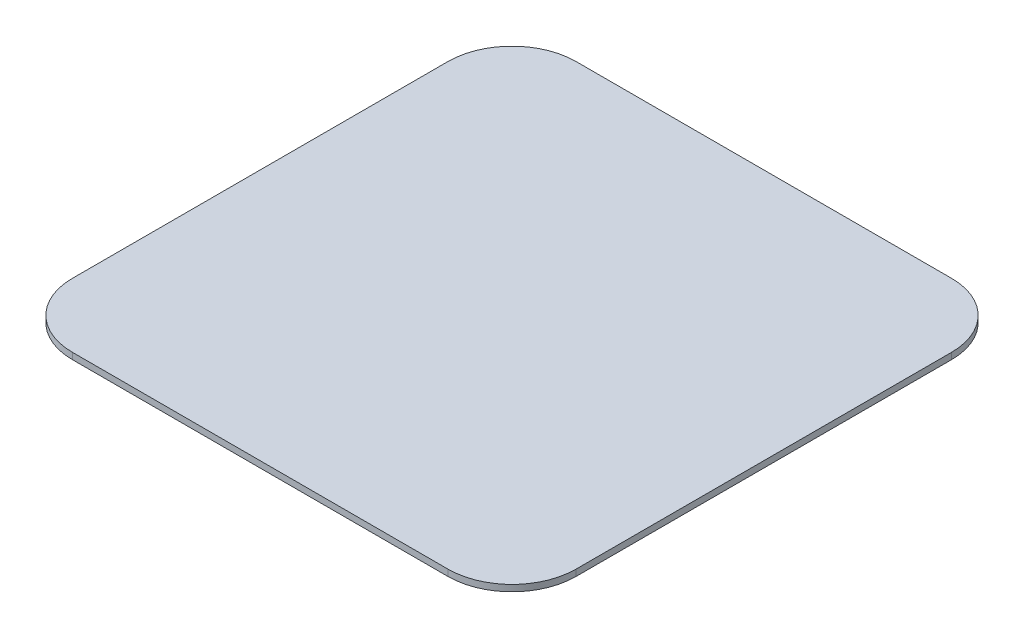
from build123d import *

# Parameters (mm, degrees)
SKETCH1_W      = 2000
SKETCH1_H      = 2000
EXTRUDE1_DEPTH = 25.4
FILLET1_R      = 254


with BuildPart() as part:
    # Sketch1 → Extrude1 (new body)
    with BuildSketch(Plane(origin=(0, 0, 0), x_dir=(1, 0, 0), z_dir=(0, 1, 0))):
        with Locations((1000, 1000)):
            Rectangle(SKETCH1_W, SKETCH1_H)
    extrude(amount=EXTRUDE1_DEPTH)

    # Fillet1
    fillet1_edges = [part.edges().sort_by_distance(p)[0] for p in [
        (0, 12.7, -2000),
        (2000, 12.7, -2000),
        (2000, 12.7, 0),
        (0, 12.7, 0),
    ]]
    fillet(fillet1_edges, radius=FILLET1_R)


solid = part.part
